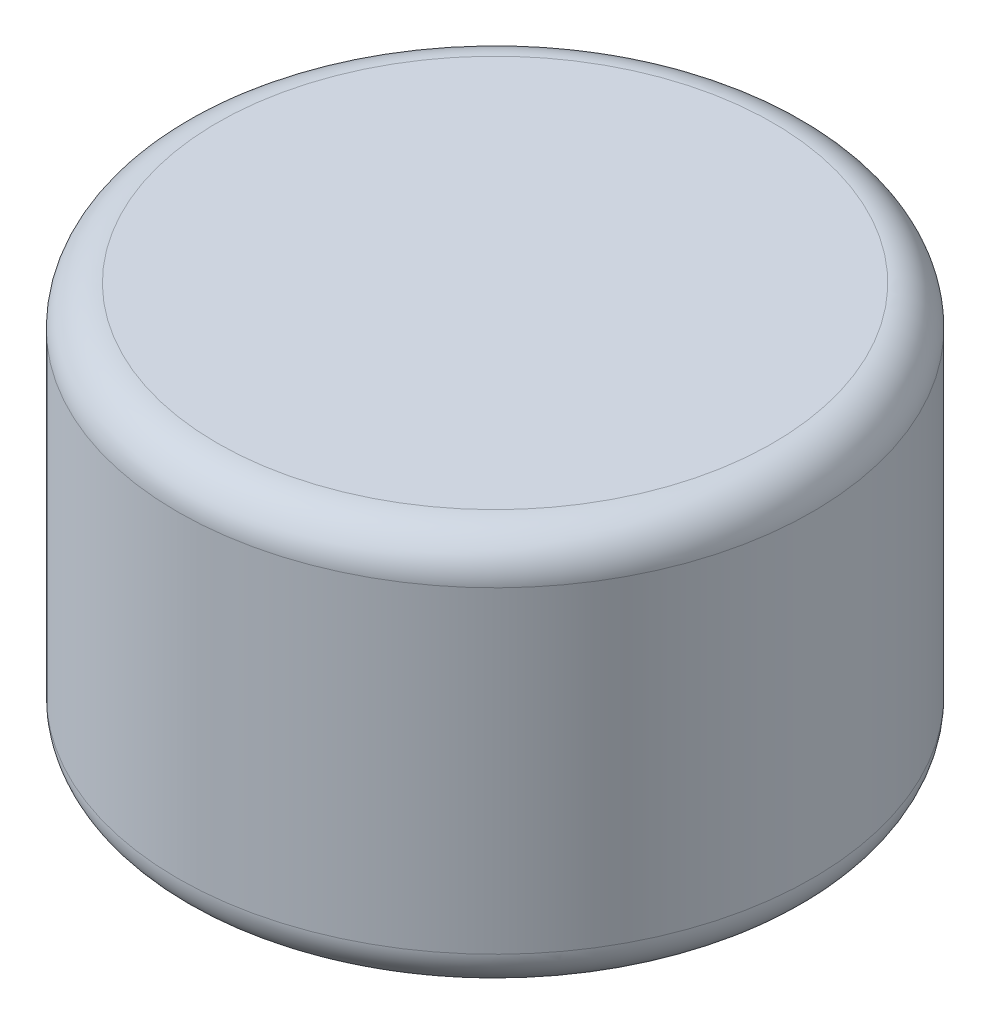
from build123d import *

# Parameters (mm, degrees)
ESQUISSE1_R      = 4
EXTRUSION1_DEPTH = 5
CONG_1_R         = 0.5


with BuildPart() as part:
    # Esquisse1 → Extrusion1 (new body)
    with BuildSketch(Plane(origin=(0, 0, 0), x_dir=(1, 0, 0), z_dir=(0, 1, 0))):
        with Locations(Location((0, 0, 0), (0, 0, 270))):
            Circle(ESQUISSE1_R)
    extrude(amount=EXTRUSION1_DEPTH)

    # Cong_1
    cong_1_edges = [part.edges().sort_by_distance(p)[0] for p in [
        (0, 0, -4),
        (0, 5, -4),
    ]]
    fillet(cong_1_edges, radius=CONG_1_R)


solid = part.part
